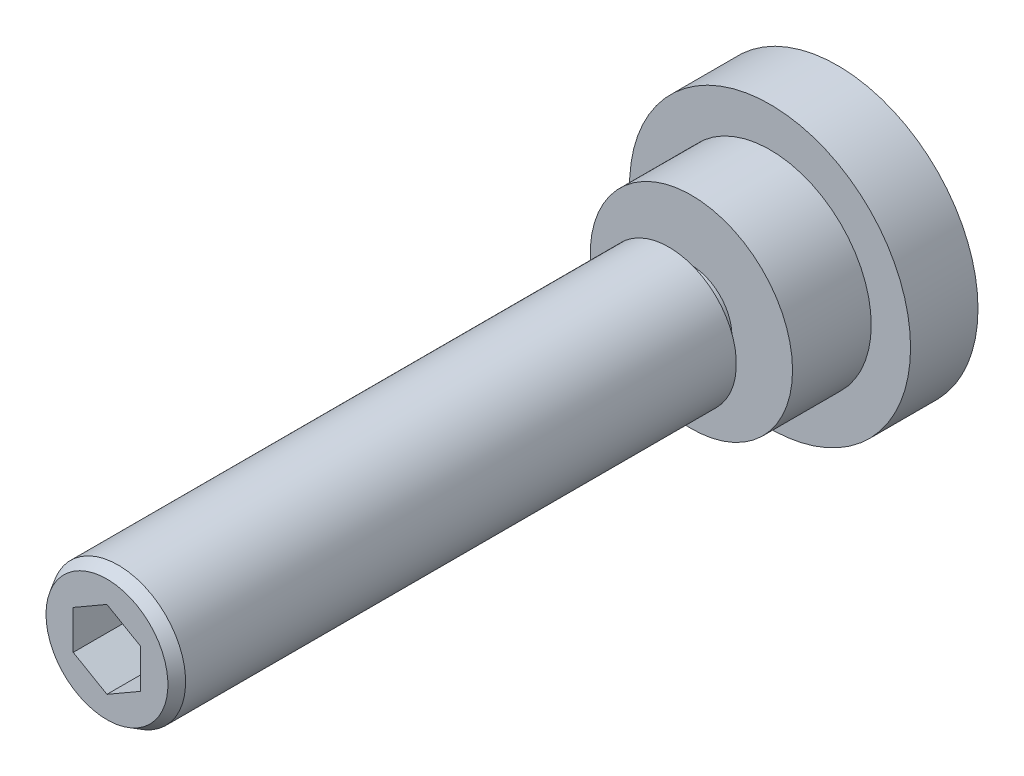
ISO-10303-21;
HEADER;
FILE_DESCRIPTION(('STEP AP214'),'2;1');
FILE_NAME('part.step','',(''),(''),'','','');
FILE_SCHEMA(('AUTOMOTIVE_DESIGN { 1 0 10303 214 1 1 1 1 }'));
ENDSEC;
DATA;
#1=APPLICATION_CONTEXT('core data for automotive mechanical design processes');
#2=APPLICATION_PROTOCOL_DEFINITION('international standard','automotive_design',2000,#1);
#3=PRODUCT_CONTEXT('',#1,'mechanical');
#4=PRODUCT('Part','Part','',(#3));
#5=PRODUCT_RELATED_PRODUCT_CATEGORY('part','',(#4));
#6=PRODUCT_DEFINITION_FORMATION('','',#4);
#7=PRODUCT_DEFINITION_CONTEXT('part definition',#1,'design');
#8=PRODUCT_DEFINITION('design','',#6,#7);
#9=PRODUCT_DEFINITION_SHAPE('','',#8);
#10=(LENGTH_UNIT() NAMED_UNIT(*) SI_UNIT(.MILLI.,.METRE.));
#11=(NAMED_UNIT(*) PLANE_ANGLE_UNIT() SI_UNIT($,.RADIAN.));
#12=(NAMED_UNIT(*) SI_UNIT($,.STERADIAN.) SOLID_ANGLE_UNIT());
#13=UNCERTAINTY_MEASURE_WITH_UNIT(LENGTH_MEASURE(1.E-05),#10,'distance_accuracy_value','');
#14=(GEOMETRIC_REPRESENTATION_CONTEXT(3) GLOBAL_UNCERTAINTY_ASSIGNED_CONTEXT((#13)) GLOBAL_UNIT_ASSIGNED_CONTEXT((#10,
#11,#12)) REPRESENTATION_CONTEXT('',''));
#15=CARTESIAN_POINT('',(0.,0.,0.));
#16=DIRECTION('',(0.,0.,1.));
#17=DIRECTION('',(1.,0.,0.));
#18=AXIS2_PLACEMENT_3D('',#15,#16,#17);
#19=CARTESIAN_POINT('',(0.,0.,0.));
#20=DIRECTION('',(0.,0.,1.));
#21=DIRECTION('',(1.,0.,0.));
#22=AXIS2_PLACEMENT_3D('',#19,#20,#21);
#23=PLANE('',#22);
#24=CARTESIAN_POINT('',(0.,0.,0.));
#25=DIRECTION('',(0.,0.,1.));
#26=DIRECTION('',(1.,0.,0.));
#27=AXIS2_PLACEMENT_3D('',#24,#25,#26);
#28=CIRCLE('',#27,12.5);
#29=CARTESIAN_POINT('',(12.5,0.,0.));
#30=VERTEX_POINT('',#29);
#31=EDGE_CURVE('E131',#30,#30,#28,.T.);
#32=ORIENTED_EDGE('',*,*,#31,.F.);
#33=EDGE_LOOP('',(#32));
#34=FACE_BOUND('',#33,.T.);
#35=ADVANCED_FACE('F14',(#34),#23,.F.);
#36=CARTESIAN_POINT('',(0.,0.,100.));
#37=DIRECTION('',(0.,0.,1.));
#38=DIRECTION('',(1.,0.,0.));
#39=AXIS2_PLACEMENT_3D('',#36,#37,#38);
#40=CYLINDRICAL_SURFACE('',#39,12.5);
#41=CARTESIAN_POINT('',(0.,0.,6.));
#42=DIRECTION('',(0.,0.,1.));
#43=DIRECTION('',(1.,0.,0.));
#44=AXIS2_PLACEMENT_3D('',#41,#42,#43);
#45=CIRCLE('',#44,12.5);
#46=CARTESIAN_POINT('',(12.5,0.,6.));
#47=VERTEX_POINT('',#46);
#48=EDGE_CURVE('E128',#47,#47,#45,.T.);
#49=ORIENTED_EDGE('',*,*,#48,.F.);
#50=EDGE_LOOP('',(#49));
#51=FACE_BOUND('',#50,.T.);
#52=ORIENTED_EDGE('',*,*,#31,.T.);
#53=EDGE_LOOP('',(#52));
#54=FACE_BOUND('',#53,.T.);
#55=ADVANCED_FACE('F149',(#51,#54),#40,.T.);
#56=CARTESIAN_POINT('',(12.5,0.,6.));
#57=DIRECTION('',(0.,0.,-1.));
#58=DIRECTION('',(-1.,0.,0.));
#59=AXIS2_PLACEMENT_3D('',#56,#57,#58);
#60=PLANE('',#59);
#61=CARTESIAN_POINT('',(0.,0.,6.));
#62=DIRECTION('',(0.,0.,1.));
#63=DIRECTION('',(1.,0.,0.));
#64=AXIS2_PLACEMENT_3D('',#61,#62,#63);
#65=CIRCLE('',#64,9.);
#66=CARTESIAN_POINT('',(9.,0.,6.));
#67=VERTEX_POINT('',#66);
#68=EDGE_CURVE('E125',#67,#67,#65,.T.);
#69=ORIENTED_EDGE('',*,*,#68,.F.);
#70=EDGE_LOOP('',(#69));
#71=FACE_BOUND('',#70,.T.);
#72=ORIENTED_EDGE('',*,*,#48,.T.);
#73=EDGE_LOOP('',(#72));
#74=FACE_BOUND('',#73,.T.);
#75=ADVANCED_FACE('F155',(#71,#74),#60,.F.);
#76=CARTESIAN_POINT('',(0.,0.,100.));
#77=DIRECTION('',(0.,0.,1.));
#78=DIRECTION('',(1.,0.,0.));
#79=AXIS2_PLACEMENT_3D('',#76,#77,#78);
#80=CYLINDRICAL_SURFACE('',#79,9.);
#81=CARTESIAN_POINT('',(0.,0.,13.));
#82=DIRECTION('',(0.,0.,1.));
#83=DIRECTION('',(1.,0.,0.));
#84=AXIS2_PLACEMENT_3D('',#81,#82,#83);
#85=CIRCLE('',#84,9.);
#86=CARTESIAN_POINT('',(9.,0.,13.));
#87=VERTEX_POINT('',#86);
#88=EDGE_CURVE('E116',#87,#87,#85,.T.);
#89=ORIENTED_EDGE('',*,*,#88,.F.);
#90=EDGE_LOOP('',(#89));
#91=FACE_BOUND('',#90,.T.);
#92=ORIENTED_EDGE('',*,*,#68,.T.);
#93=EDGE_LOOP('',(#92));
#94=FACE_BOUND('',#93,.T.);
#95=ADVANCED_FACE('F162',(#91,#94),#80,.T.);
#96=CARTESIAN_POINT('',(9.,0.,13.));
#97=DIRECTION('',(0.,0.,-1.));
#98=DIRECTION('',(-1.,0.,0.));
#99=AXIS2_PLACEMENT_3D('',#96,#97,#98);
#100=PLANE('',#99);
#101=ORIENTED_EDGE('',*,*,#88,.T.);
#102=EDGE_LOOP('',(#101));
#103=FACE_BOUND('',#102,.T.);
#104=CARTESIAN_POINT('',(0.,0.,13.));
#105=DIRECTION('',(0.,0.,-1.));
#106=DIRECTION('',(-1.,0.,0.));
#107=AXIS2_PLACEMENT_3D('',#104,#105,#106);
#108=CIRCLE('',#107,3.6);
#109=CARTESIAN_POINT('',(-3.6,0.,13.));
#110=VERTEX_POINT('',#109);
#111=EDGE_CURVE('E214',#110,#110,#108,.T.);
#112=ORIENTED_EDGE('',*,*,#111,.T.);
#113=EDGE_LOOP('',(#112));
#114=FACE_BOUND('',#113,.T.);
#115=ADVANCED_FACE('F166',(#103,#114),#100,.F.);
#116=CARTESIAN_POINT('',(0.,0.,0.));
#117=DIRECTION('',(0.,0.,-1.));
#118=DIRECTION('',(-1.,0.,0.));
#119=AXIS2_PLACEMENT_3D('',#116,#117,#118);
#120=CYLINDRICAL_SURFACE('',#119,3.6);
#121=ORIENTED_EDGE('',*,*,#111,.F.);
#122=EDGE_LOOP('',(#121));
#123=FACE_BOUND('',#122,.T.);
#124=CARTESIAN_POINT('',(0.,0.,13.6143593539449));
#125=DIRECTION('',(0.,0.,-1.));
#126=DIRECTION('',(-1.,0.,0.));
#127=AXIS2_PLACEMENT_3D('',#124,#125,#126);
#128=CIRCLE('',#127,3.6);
#129=CARTESIAN_POINT('',(-3.6,0.,13.6143593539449));
#130=VERTEX_POINT('',#129);
#131=EDGE_CURVE('E208',#130,#130,#128,.T.);
#132=ORIENTED_EDGE('',*,*,#131,.T.);
#133=EDGE_LOOP('',(#132));
#134=FACE_BOUND('',#133,.T.);
#135=ADVANCED_FACE('F169',(#123,#134),#120,.T.);
#136=CARTESIAN_POINT('',(0.,0.,15.));
#137=DIRECTION('',(0.,0.,1.));
#138=DIRECTION('',(1.,0.,0.));
#139=AXIS2_PLACEMENT_3D('',#136,#137,#138);
#140=CONICAL_SURFACE('',#139,6.,1.0471975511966);
#141=ORIENTED_EDGE('',*,*,#131,.F.);
#142=EDGE_LOOP('',(#141));
#143=FACE_BOUND('',#142,.T.);
#144=CARTESIAN_POINT('',(0.,0.,15.));
#145=DIRECTION('',(0.,0.,-1.));
#146=DIRECTION('',(-1.,0.,0.));
#147=AXIS2_PLACEMENT_3D('',#144,#145,#146);
#148=CIRCLE('',#147,6.);
#149=CARTESIAN_POINT('',(-6.,0.,15.));
#150=VERTEX_POINT('',#149);
#151=EDGE_CURVE('E211',#150,#150,#148,.T.);
#152=ORIENTED_EDGE('',*,*,#151,.T.);
#153=EDGE_LOOP('',(#152));
#154=FACE_BOUND('',#153,.T.);
#155=ADVANCED_FACE('F195',(#143,#154),#140,.T.);
#156=CARTESIAN_POINT('',(-3.,5.19615242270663,60.));
#157=DIRECTION('',(0.,0.,1.));
#158=DIRECTION('',(1.,0.,0.));
#159=AXIS2_PLACEMENT_3D('',#156,#157,#158);
#160=PLANE('',#159);
#161=DIRECTION('',(-0.866025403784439,0.5,0.));
#162=VECTOR('',#161,1.);
#163=CARTESIAN_POINT('',(3.,1.73205080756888,60.));
#164=LINE('',#163,#162);
#165=CARTESIAN_POINT('',(3.,1.73205080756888,60.));
#166=VERTEX_POINT('',#165);
#167=CARTESIAN_POINT('',(0.,3.46410161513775,60.));
#168=VERTEX_POINT('',#167);
#169=EDGE_CURVE('E100',#166,#168,#164,.T.);
#170=ORIENTED_EDGE('',*,*,#169,.T.);
#171=DIRECTION('',(-0.866025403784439,-0.5,0.));
#172=VECTOR('',#171,1.);
#173=CARTESIAN_POINT('',(0.,3.46410161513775,60.));
#174=LINE('',#173,#172);
#175=CARTESIAN_POINT('',(-3.,1.73205080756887,60.));
#176=VERTEX_POINT('',#175);
#177=EDGE_CURVE('E103',#168,#176,#174,.T.);
#178=ORIENTED_EDGE('',*,*,#177,.T.);
#179=DIRECTION('',(0.,-1.,0.));
#180=VECTOR('',#179,1.);
#181=CARTESIAN_POINT('',(-3.,1.73205080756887,60.));
#182=LINE('',#181,#180);
#183=CARTESIAN_POINT('',(-3.,-1.73205080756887,60.));
#184=VERTEX_POINT('',#183);
#185=EDGE_CURVE('E75',#176,#184,#182,.T.);
#186=ORIENTED_EDGE('',*,*,#185,.T.);
#187=DIRECTION('',(0.866025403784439,-0.5,0.));
#188=VECTOR('',#187,1.);
#189=CARTESIAN_POINT('',(-3.,-1.73205080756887,60.));
#190=LINE('',#189,#188);
#191=CARTESIAN_POINT('',(0.,-3.46410161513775,60.));
#192=VERTEX_POINT('',#191);
#193=EDGE_CURVE('E106',#184,#192,#190,.T.);
#194=ORIENTED_EDGE('',*,*,#193,.T.);
#195=DIRECTION('',(0.866025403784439,0.5,0.));
#196=VECTOR('',#195,1.);
#197=CARTESIAN_POINT('',(0.,-3.46410161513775,60.));
#198=LINE('',#197,#196);
#199=CARTESIAN_POINT('',(3.,-1.73205080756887,60.));
#200=VERTEX_POINT('',#199);
#201=EDGE_CURVE('E109',#192,#200,#198,.T.);
#202=ORIENTED_EDGE('',*,*,#201,.T.);
#203=DIRECTION('',(0.,1.,0.));
#204=VECTOR('',#203,1.);
#205=CARTESIAN_POINT('',(3.,-1.73205080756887,60.));
#206=LINE('',#205,#204);
#207=EDGE_CURVE('E112',#200,#166,#206,.T.);
#208=ORIENTED_EDGE('',*,*,#207,.T.);
#209=EDGE_LOOP('',(#170,#178,#186,#194,#202,#208));
#210=FACE_BOUND('',#209,.T.);
#211=ADVANCED_FACE('F183',(#210),#160,.T.);
#212=CARTESIAN_POINT('',(-3.,1.73205080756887,60.));
#213=DIRECTION('',(-1.,0.,0.));
#214=DIRECTION('',(0.,0.,1.));
#215=AXIS2_PLACEMENT_3D('',#212,#213,#214);
#216=PLANE('',#215);
#217=DIRECTION('',(0.,-1.,0.));
#218=VECTOR('',#217,1.);
#219=CARTESIAN_POINT('',(-3.,1.73205080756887,65.));
#220=LINE('',#219,#218);
#221=CARTESIAN_POINT('',(-3.,1.73205080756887,65.));
#222=VERTEX_POINT('',#221);
#223=CARTESIAN_POINT('',(-3.,-1.73205080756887,65.));
#224=VERTEX_POINT('',#223);
#225=EDGE_CURVE('E72',#222,#224,#220,.T.);
#226=ORIENTED_EDGE('',*,*,#225,.T.);
#227=DIRECTION('',(0.,0.,1.));
#228=VECTOR('',#227,1.);
#229=CARTESIAN_POINT('',(-3.,-1.73205080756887,60.));
#230=LINE('',#229,#228);
#231=EDGE_CURVE('E79',#184,#224,#230,.T.);
#232=ORIENTED_EDGE('',*,*,#231,.F.);
#233=ORIENTED_EDGE('',*,*,#185,.F.);
#234=DIRECTION('',(0.,0.,1.));
#235=VECTOR('',#234,1.);
#236=CARTESIAN_POINT('',(-3.,1.73205080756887,60.));
#237=LINE('',#236,#235);
#238=EDGE_CURVE('E68',#176,#222,#237,.T.);
#239=ORIENTED_EDGE('',*,*,#238,.T.);
#240=EDGE_LOOP('',(#226,#232,#233,#239));
#241=FACE_BOUND('',#240,.T.);
#242=ADVANCED_FACE('F70',(#241),#216,.F.);
#243=CARTESIAN_POINT('',(-3.,-1.73205080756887,60.));
#244=DIRECTION('',(-0.5,-0.866025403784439,0.));
#245=DIRECTION('',(0.866025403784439,-0.5,0.));
#246=AXIS2_PLACEMENT_3D('',#243,#244,#245);
#247=PLANE('',#246);
#248=DIRECTION('',(0.866025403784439,-0.5,0.));
#249=VECTOR('',#248,1.);
#250=CARTESIAN_POINT('',(-3.,-1.73205080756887,65.));
#251=LINE('',#250,#249);
#252=CARTESIAN_POINT('',(0.,-3.46410161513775,65.));
#253=VERTEX_POINT('',#252);
#254=EDGE_CURVE('E90',#224,#253,#251,.T.);
#255=ORIENTED_EDGE('',*,*,#254,.T.);
#256=DIRECTION('',(0.,0.,1.));
#257=VECTOR('',#256,1.);
#258=CARTESIAN_POINT('',(0.,-3.46410161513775,60.));
#259=LINE('',#258,#257);
#260=EDGE_CURVE('E119',#192,#253,#259,.T.);
#261=ORIENTED_EDGE('',*,*,#260,.F.);
#262=ORIENTED_EDGE('',*,*,#193,.F.);
#263=ORIENTED_EDGE('',*,*,#231,.T.);
#264=EDGE_LOOP('',(#255,#261,#262,#263));
#265=FACE_BOUND('',#264,.T.);
#266=ADVANCED_FACE('F182',(#265),#247,.F.);
#267=CARTESIAN_POINT('',(0.,-3.46410161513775,60.));
#268=DIRECTION('',(0.5,-0.866025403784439,0.));
#269=DIRECTION('',(0.866025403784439,0.5,0.));
#270=AXIS2_PLACEMENT_3D('',#267,#268,#269);
#271=PLANE('',#270);
#272=DIRECTION('',(0.866025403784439,0.5,0.));
#273=VECTOR('',#272,1.);
#274=CARTESIAN_POINT('',(0.,-3.46410161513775,65.));
#275=LINE('',#274,#273);
#276=CARTESIAN_POINT('',(3.,-1.73205080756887,65.));
#277=VERTEX_POINT('',#276);
#278=EDGE_CURVE('E92',#253,#277,#275,.T.);
#279=ORIENTED_EDGE('',*,*,#278,.T.);
#280=DIRECTION('',(0.,0.,1.));
#281=VECTOR('',#280,1.);
#282=CARTESIAN_POINT('',(3.,-1.73205080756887,60.));
#283=LINE('',#282,#281);
#284=EDGE_CURVE('E117',#200,#277,#283,.T.);
#285=ORIENTED_EDGE('',*,*,#284,.F.);
#286=ORIENTED_EDGE('',*,*,#201,.F.);
#287=ORIENTED_EDGE('',*,*,#260,.T.);
#288=EDGE_LOOP('',(#279,#285,#286,#287));
#289=FACE_BOUND('',#288,.T.);
#290=ADVANCED_FACE('F186',(#289),#271,.F.);
#291=CARTESIAN_POINT('',(3.,-1.73205080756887,60.));
#292=DIRECTION('',(1.,0.,0.));
#293=DIRECTION('',(0.,0.,-1.));
#294=AXIS2_PLACEMENT_3D('',#291,#292,#293);
#295=PLANE('',#294);
#296=DIRECTION('',(0.,1.,0.));
#297=VECTOR('',#296,1.);
#298=CARTESIAN_POINT('',(3.,-1.73205080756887,65.));
#299=LINE('',#298,#297);
#300=CARTESIAN_POINT('',(3.,1.73205080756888,65.));
#301=VERTEX_POINT('',#300);
#302=EDGE_CURVE('E98',#277,#301,#299,.T.);
#303=ORIENTED_EDGE('',*,*,#302,.T.);
#304=DIRECTION('',(0.,0.,1.));
#305=VECTOR('',#304,1.);
#306=CARTESIAN_POINT('',(3.,1.73205080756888,60.));
#307=LINE('',#306,#305);
#308=EDGE_CURVE('E36',#166,#301,#307,.T.);
#309=ORIENTED_EDGE('',*,*,#308,.F.);
#310=ORIENTED_EDGE('',*,*,#207,.F.);
#311=ORIENTED_EDGE('',*,*,#284,.T.);
#312=EDGE_LOOP('',(#303,#309,#310,#311));
#313=FACE_BOUND('',#312,.T.);
#314=ADVANCED_FACE('F177',(#313),#295,.F.);
#315=CARTESIAN_POINT('',(3.,1.73205080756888,60.));
#316=DIRECTION('',(0.5,0.866025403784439,0.));
#317=DIRECTION('',(-0.866025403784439,0.5,0.));
#318=AXIS2_PLACEMENT_3D('',#315,#316,#317);
#319=PLANE('',#318);
#320=DIRECTION('',(-0.866025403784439,0.5,0.));
#321=VECTOR('',#320,1.);
#322=CARTESIAN_POINT('',(3.,1.73205080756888,65.));
#323=LINE('',#322,#321);
#324=CARTESIAN_POINT('',(0.,3.46410161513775,65.));
#325=VERTEX_POINT('',#324);
#326=EDGE_CURVE('E29',#301,#325,#323,.T.);
#327=ORIENTED_EDGE('',*,*,#326,.T.);
#328=DIRECTION('',(0.,0.,1.));
#329=VECTOR('',#328,1.);
#330=CARTESIAN_POINT('',(0.,3.46410161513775,60.));
#331=LINE('',#330,#329);
#332=EDGE_CURVE('E80',#168,#325,#331,.T.);
#333=ORIENTED_EDGE('',*,*,#332,.F.);
#334=ORIENTED_EDGE('',*,*,#169,.F.);
#335=ORIENTED_EDGE('',*,*,#308,.T.);
#336=EDGE_LOOP('',(#327,#333,#334,#335));
#337=FACE_BOUND('',#336,.T.);
#338=ADVANCED_FACE('F174',(#337),#319,.F.);
#339=CARTESIAN_POINT('',(0.,3.46410161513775,60.));
#340=DIRECTION('',(-0.5,0.866025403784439,0.));
#341=DIRECTION('',(-0.866025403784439,-0.5,0.));
#342=AXIS2_PLACEMENT_3D('',#339,#340,#341);
#343=PLANE('',#342);
#344=DIRECTION('',(-0.866025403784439,-0.5,0.));
#345=VECTOR('',#344,1.);
#346=CARTESIAN_POINT('',(0.,3.46410161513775,65.));
#347=LINE('',#346,#345);
#348=EDGE_CURVE('E83',#325,#222,#347,.T.);
#349=ORIENTED_EDGE('',*,*,#348,.T.);
#350=ORIENTED_EDGE('',*,*,#238,.F.);
#351=ORIENTED_EDGE('',*,*,#177,.F.);
#352=ORIENTED_EDGE('',*,*,#332,.T.);
#353=EDGE_LOOP('',(#349,#350,#351,#352));
#354=FACE_BOUND('',#353,.T.);
#355=ADVANCED_FACE('F84',(#354),#343,.F.);
#356=CARTESIAN_POINT('',(6.,0.,65.));
#357=DIRECTION('',(0.,0.,-1.));
#358=DIRECTION('',(-1.,0.,0.));
#359=AXIS2_PLACEMENT_3D('',#356,#357,#358);
#360=PLANE('',#359);
#361=CARTESIAN_POINT('',(0.,0.,65.));
#362=DIRECTION('',(0.,0.,-1.));
#363=DIRECTION('',(-1.,0.,0.));
#364=AXIS2_PLACEMENT_3D('',#361,#362,#363);
#365=CIRCLE('',#364,5.42264973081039);
#366=CARTESIAN_POINT('',(-5.42264973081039,0.,65.));
#367=VERTEX_POINT('',#366);
#368=EDGE_CURVE('E22',#367,#367,#365,.F.);
#369=ORIENTED_EDGE('',*,*,#368,.T.);
#370=EDGE_LOOP('',(#369));
#371=FACE_BOUND('',#370,.T.);
#372=ORIENTED_EDGE('',*,*,#348,.F.);
#373=ORIENTED_EDGE('',*,*,#326,.F.);
#374=ORIENTED_EDGE('',*,*,#302,.F.);
#375=ORIENTED_EDGE('',*,*,#278,.F.);
#376=ORIENTED_EDGE('',*,*,#254,.F.);
#377=ORIENTED_EDGE('',*,*,#225,.F.);
#378=EDGE_LOOP('',(#372,#373,#374,#375,#376,#377));
#379=FACE_BOUND('',#378,.T.);
#380=ADVANCED_FACE('F87',(#371,#379),#360,.F.);
#381=CARTESIAN_POINT('',(0.,0.,100.));
#382=DIRECTION('',(0.,0.,1.));
#383=DIRECTION('',(1.,0.,0.));
#384=AXIS2_PLACEMENT_3D('',#381,#382,#383);
#385=CYLINDRICAL_SURFACE('',#384,6.);
#386=CARTESIAN_POINT('',(0.,0.,64.));
#387=DIRECTION('',(0.,0.,-1.));
#388=DIRECTION('',(-1.,0.,0.));
#389=AXIS2_PLACEMENT_3D('',#386,#387,#388);
#390=CIRCLE('',#389,6.);
#391=CARTESIAN_POINT('',(-6.,0.,64.));
#392=VERTEX_POINT('',#391);
#393=EDGE_CURVE('E9',#392,#392,#390,.T.);
#394=ORIENTED_EDGE('',*,*,#393,.T.);
#395=EDGE_LOOP('',(#394));
#396=FACE_BOUND('',#395,.T.);
#397=ORIENTED_EDGE('',*,*,#151,.F.);
#398=EDGE_LOOP('',(#397));
#399=FACE_BOUND('',#398,.T.);
#400=ADVANCED_FACE('F138',(#396,#399),#385,.T.);
#401=CARTESIAN_POINT('',(0.,0.,65.));
#402=DIRECTION('',(0.,0.,-1.));
#403=DIRECTION('',(-1.,0.,0.));
#404=AXIS2_PLACEMENT_3D('',#401,#402,#403);
#405=CONICAL_SURFACE('',#404,5.42264973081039,0.5235987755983);
#406=ORIENTED_EDGE('',*,*,#393,.F.);
#407=EDGE_LOOP('',(#406));
#408=FACE_BOUND('',#407,.T.);
#409=ORIENTED_EDGE('',*,*,#368,.F.);
#410=EDGE_LOOP('',(#409));
#411=FACE_BOUND('',#410,.T.);
#412=ADVANCED_FACE('F16',(#408,#411),#405,.T.);
#413=CLOSED_SHELL('',(#35,#55,#75,#95,#115,#135,#155,#211,#242,#266,#290,#314,#338,#355,#380,
#400,#412));
#414=MANIFOLD_SOLID_BREP('B1',#413);
#415=ADVANCED_BREP_SHAPE_REPRESENTATION('',(#18,#414),#14);
#416=SHAPE_DEFINITION_REPRESENTATION(#9,#415);
ENDSEC;
END-ISO-10303-21;
